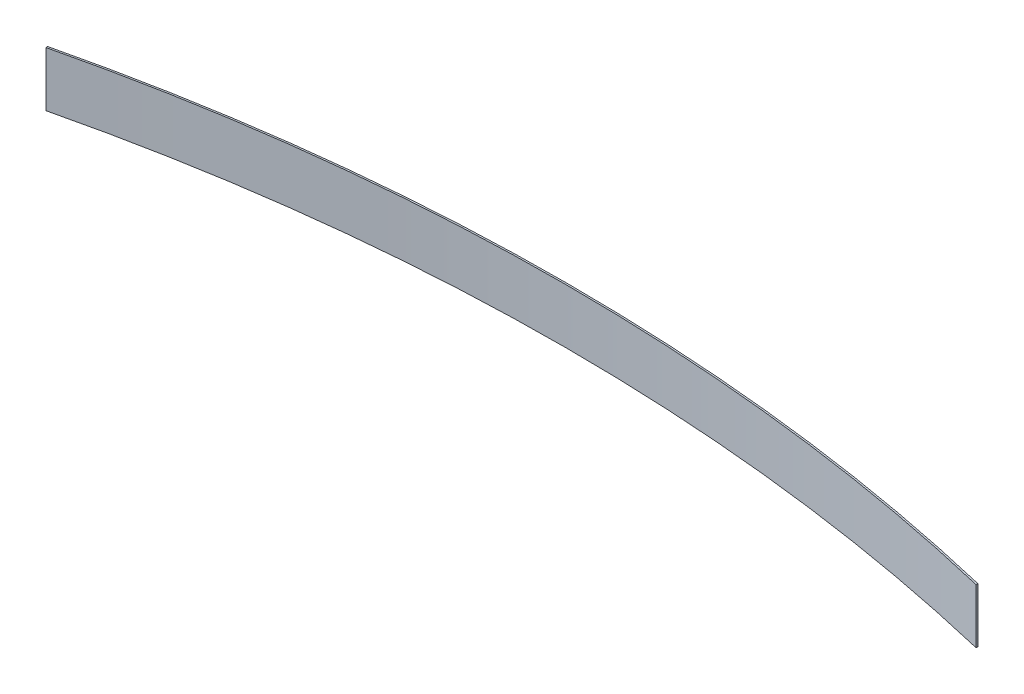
ISO-10303-21;
HEADER;
FILE_DESCRIPTION(('STEP AP214'),'2;1');
FILE_NAME('part.step','',(''),(''),'','','');
FILE_SCHEMA(('AUTOMOTIVE_DESIGN { 1 0 10303 214 1 1 1 1 }'));
ENDSEC;
DATA;
#1=APPLICATION_CONTEXT('core data for automotive mechanical design processes');
#2=APPLICATION_PROTOCOL_DEFINITION('international standard','automotive_design',2000,#1);
#3=PRODUCT_CONTEXT('',#1,'mechanical');
#4=PRODUCT('Part','Part','',(#3));
#5=PRODUCT_RELATED_PRODUCT_CATEGORY('part','',(#4));
#6=PRODUCT_DEFINITION_FORMATION('','',#4);
#7=PRODUCT_DEFINITION_CONTEXT('part definition',#1,'design');
#8=PRODUCT_DEFINITION('design','',#6,#7);
#9=PRODUCT_DEFINITION_SHAPE('','',#8);
#10=(LENGTH_UNIT() NAMED_UNIT(*) SI_UNIT(.MILLI.,.METRE.));
#11=(NAMED_UNIT(*) PLANE_ANGLE_UNIT() SI_UNIT($,.RADIAN.));
#12=(NAMED_UNIT(*) SI_UNIT($,.STERADIAN.) SOLID_ANGLE_UNIT());
#13=UNCERTAINTY_MEASURE_WITH_UNIT(LENGTH_MEASURE(1.E-05),#10,'distance_accuracy_value','');
#14=(GEOMETRIC_REPRESENTATION_CONTEXT(3) GLOBAL_UNCERTAINTY_ASSIGNED_CONTEXT((#13)) GLOBAL_UNIT_ASSIGNED_CONTEXT((#10,
#11,#12)) REPRESENTATION_CONTEXT('',''));
#15=CARTESIAN_POINT('',(0.,0.,0.));
#16=DIRECTION('',(0.,0.,1.));
#17=DIRECTION('',(1.,0.,0.));
#18=AXIS2_PLACEMENT_3D('',#15,#16,#17);
#19=CARTESIAN_POINT('',(863.600000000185,101.6,3619.50000000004));
#20=DIRECTION('',(0.,-1.,0.));
#21=DIRECTION('',(0.,0.,-1.));
#22=AXIS2_PLACEMENT_3D('',#19,#20,#21);
#23=CYLINDRICAL_SURFACE('',#22,3721.1);
#24=CARTESIAN_POINT('',(863.600000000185,0.,3619.50000000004));
#25=DIRECTION('',(0.,-1.,0.));
#26=DIRECTION('',(0.,0.,-1.));
#27=AXIS2_PLACEMENT_3D('',#24,#25,#26);
#28=CIRCLE('',#27,3721.1);
#29=CARTESIAN_POINT('',(-1.55431223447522E-12,0.,8.8484775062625E-11));
#30=VERTEX_POINT('',#29);
#31=CARTESIAN_POINT('',(1727.2,0.,0.));
#32=VERTEX_POINT('',#31);
#33=EDGE_CURVE('E11',#30,#32,#28,.T.);
#34=ORIENTED_EDGE('',*,*,#33,.T.);
#35=DIRECTION('',(0.,-1.,0.));
#36=VECTOR('',#35,1.);
#37=CARTESIAN_POINT('',(1727.2,101.6,0.));
#38=LINE('',#37,#36);
#39=CARTESIAN_POINT('',(1727.2,101.6,0.));
#40=VERTEX_POINT('',#39);
#41=EDGE_CURVE('E71',#40,#32,#38,.T.);
#42=ORIENTED_EDGE('',*,*,#41,.F.);
#43=CARTESIAN_POINT('',(863.600000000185,101.6,3619.50000000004));
#44=DIRECTION('',(0.,-1.,0.));
#45=DIRECTION('',(0.,0.,-1.));
#46=AXIS2_PLACEMENT_3D('',#43,#44,#45);
#47=CIRCLE('',#46,3721.1);
#48=CARTESIAN_POINT('',(-1.55431223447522E-12,101.6,8.8484775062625E-11));
#49=VERTEX_POINT('',#48);
#50=EDGE_CURVE('E46',#49,#40,#47,.T.);
#51=ORIENTED_EDGE('',*,*,#50,.F.);
#52=DIRECTION('',(0.,-1.,0.));
#53=VECTOR('',#52,1.);
#54=CARTESIAN_POINT('',(-1.55431223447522E-12,101.6,8.8484775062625E-11));
#55=LINE('',#54,#53);
#56=EDGE_CURVE('E73',#49,#30,#55,.T.);
#57=ORIENTED_EDGE('',*,*,#56,.T.);
#58=EDGE_LOOP('',(#34,#42,#51,#57));
#59=FACE_BOUND('',#58,.T.);
#60=ADVANCED_FACE('F31',(#59),#23,.F.);
#61=CARTESIAN_POINT('',(-1.55431223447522E-12,0.,8.8484775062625E-11));
#62=DIRECTION('',(0.,-1.,0.));
#63=DIRECTION('',(0.,0.,-1.));
#64=AXIS2_PLACEMENT_3D('',#61,#62,#63);
#65=PLANE('',#64);
#66=CARTESIAN_POINT('',(863.600000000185,0.,3619.50000000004));
#67=DIRECTION('',(0.,-1.,0.));
#68=DIRECTION('',(0.,0.,-1.));
#69=AXIS2_PLACEMENT_3D('',#66,#67,#68);
#70=CIRCLE('',#69,3724.275);
#71=CARTESIAN_POINT('',(-0.736860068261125,0.,-3.08831058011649));
#72=VERTEX_POINT('',#71);
#73=CARTESIAN_POINT('',(1727.93686006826,0.,-3.08831058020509));
#74=VERTEX_POINT('',#73);
#75=EDGE_CURVE('E39',#72,#74,#70,.T.);
#76=ORIENTED_EDGE('',*,*,#75,.T.);
#77=DIRECTION('',(0.232081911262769,0.,-0.972696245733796));
#78=VECTOR('',#77,1.);
#79=CARTESIAN_POINT('',(1727.2,0.,0.));
#80=LINE('',#79,#78);
#81=EDGE_CURVE('E82',#32,#74,#80,.T.);
#82=ORIENTED_EDGE('',*,*,#81,.F.);
#83=ORIENTED_EDGE('',*,*,#33,.F.);
#84=DIRECTION('',(-0.232081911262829,0.,-0.972696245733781));
#85=VECTOR('',#84,1.);
#86=CARTESIAN_POINT('',(-1.55431223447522E-12,0.,8.8484775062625E-11));
#87=LINE('',#86,#85);
#88=EDGE_CURVE('E92',#30,#72,#87,.T.);
#89=ORIENTED_EDGE('',*,*,#88,.T.);
#90=EDGE_LOOP('',(#76,#82,#83,#89));
#91=FACE_BOUND('',#90,.T.);
#92=ADVANCED_FACE('F33',(#91),#65,.T.);
#93=CARTESIAN_POINT('',(863.600000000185,101.6,3619.50000000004));
#94=DIRECTION('',(0.,-1.,0.));
#95=DIRECTION('',(0.,0.,-1.));
#96=AXIS2_PLACEMENT_3D('',#93,#94,#95);
#97=CYLINDRICAL_SURFACE('',#96,3724.275);
#98=CARTESIAN_POINT('',(863.600000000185,101.6,3619.50000000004));
#99=DIRECTION('',(0.,-1.,0.));
#100=DIRECTION('',(0.,0.,-1.));
#101=AXIS2_PLACEMENT_3D('',#98,#99,#100);
#102=CIRCLE('',#101,3724.275);
#103=CARTESIAN_POINT('',(-0.736860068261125,101.6,-3.08831058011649));
#104=VERTEX_POINT('',#103);
#105=CARTESIAN_POINT('',(1727.93686006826,101.6,-3.08831058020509));
#106=VERTEX_POINT('',#105);
#107=EDGE_CURVE('E54',#104,#106,#102,.T.);
#108=ORIENTED_EDGE('',*,*,#107,.T.);
#109=DIRECTION('',(0.,1.,0.));
#110=VECTOR('',#109,1.);
#111=CARTESIAN_POINT('',(1727.93686006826,0.,-3.08831058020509));
#112=LINE('',#111,#110);
#113=EDGE_CURVE('E86',#74,#106,#112,.T.);
#114=ORIENTED_EDGE('',*,*,#113,.F.);
#115=ORIENTED_EDGE('',*,*,#75,.F.);
#116=DIRECTION('',(0.,1.,0.));
#117=VECTOR('',#116,1.);
#118=CARTESIAN_POINT('',(-0.736860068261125,0.,-3.08831058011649));
#119=LINE('',#118,#117);
#120=EDGE_CURVE('E94',#72,#104,#119,.T.);
#121=ORIENTED_EDGE('',*,*,#120,.T.);
#122=EDGE_LOOP('',(#108,#114,#115,#121));
#123=FACE_BOUND('',#122,.T.);
#124=ADVANCED_FACE('F100',(#123),#97,.T.);
#125=CARTESIAN_POINT('',(-0.736860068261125,101.6,-3.08831058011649));
#126=DIRECTION('',(0.,1.,0.));
#127=DIRECTION('',(0.,0.,1.));
#128=AXIS2_PLACEMENT_3D('',#125,#126,#127);
#129=PLANE('',#128);
#130=DIRECTION('',(0.232081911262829,0.,0.972696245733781));
#131=VECTOR('',#130,1.);
#132=CARTESIAN_POINT('',(-0.736860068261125,101.6,-3.08831058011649));
#133=LINE('',#132,#131);
#134=EDGE_CURVE('E96',#104,#49,#133,.T.);
#135=ORIENTED_EDGE('',*,*,#134,.T.);
#136=ORIENTED_EDGE('',*,*,#50,.T.);
#137=DIRECTION('',(-0.232081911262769,0.,0.972696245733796));
#138=VECTOR('',#137,1.);
#139=CARTESIAN_POINT('',(1727.93686006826,101.6,-3.08831058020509));
#140=LINE('',#139,#138);
#141=EDGE_CURVE('E84',#106,#40,#140,.T.);
#142=ORIENTED_EDGE('',*,*,#141,.F.);
#143=ORIENTED_EDGE('',*,*,#107,.F.);
#144=EDGE_LOOP('',(#135,#136,#142,#143));
#145=FACE_BOUND('',#144,.T.);
#146=ADVANCED_FACE('F103',(#145),#129,.T.);
#147=CARTESIAN_POINT('',(-1.55431223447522E-12,0.,8.8484775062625E-11));
#148=DIRECTION('',(0.972696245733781,0.,-0.232081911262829));
#149=DIRECTION('',(-0.232081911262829,0.,-0.972696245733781));
#150=AXIS2_PLACEMENT_3D('',#147,#148,#149);
#151=PLANE('',#150);
#152=ORIENTED_EDGE('',*,*,#56,.F.);
#153=ORIENTED_EDGE('',*,*,#134,.F.);
#154=ORIENTED_EDGE('',*,*,#120,.F.);
#155=ORIENTED_EDGE('',*,*,#88,.F.);
#156=EDGE_LOOP('',(#152,#153,#154,#155));
#157=FACE_BOUND('',#156,.T.);
#158=ADVANCED_FACE('F105',(#157),#151,.F.);
#159=CARTESIAN_POINT('',(1727.2,0.,0.));
#160=DIRECTION('',(0.972696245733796,0.,0.232081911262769));
#161=DIRECTION('',(0.232081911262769,0.,-0.972696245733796));
#162=AXIS2_PLACEMENT_3D('',#159,#160,#161);
#163=PLANE('',#162);
#164=ORIENTED_EDGE('',*,*,#41,.T.);
#165=ORIENTED_EDGE('',*,*,#81,.T.);
#166=ORIENTED_EDGE('',*,*,#113,.T.);
#167=ORIENTED_EDGE('',*,*,#141,.T.);
#168=EDGE_LOOP('',(#164,#165,#166,#167));
#169=FACE_BOUND('',#168,.T.);
#170=ADVANCED_FACE('F80',(#169),#163,.T.);
#171=CLOSED_SHELL('',(#60,#92,#124,#146,#158,#170));
#172=MANIFOLD_SOLID_BREP('B2',#171);
#173=ADVANCED_BREP_SHAPE_REPRESENTATION('',(#18,#172),#14);
#174=SHAPE_DEFINITION_REPRESENTATION(#9,#173);
ENDSEC;
END-ISO-10303-21;
